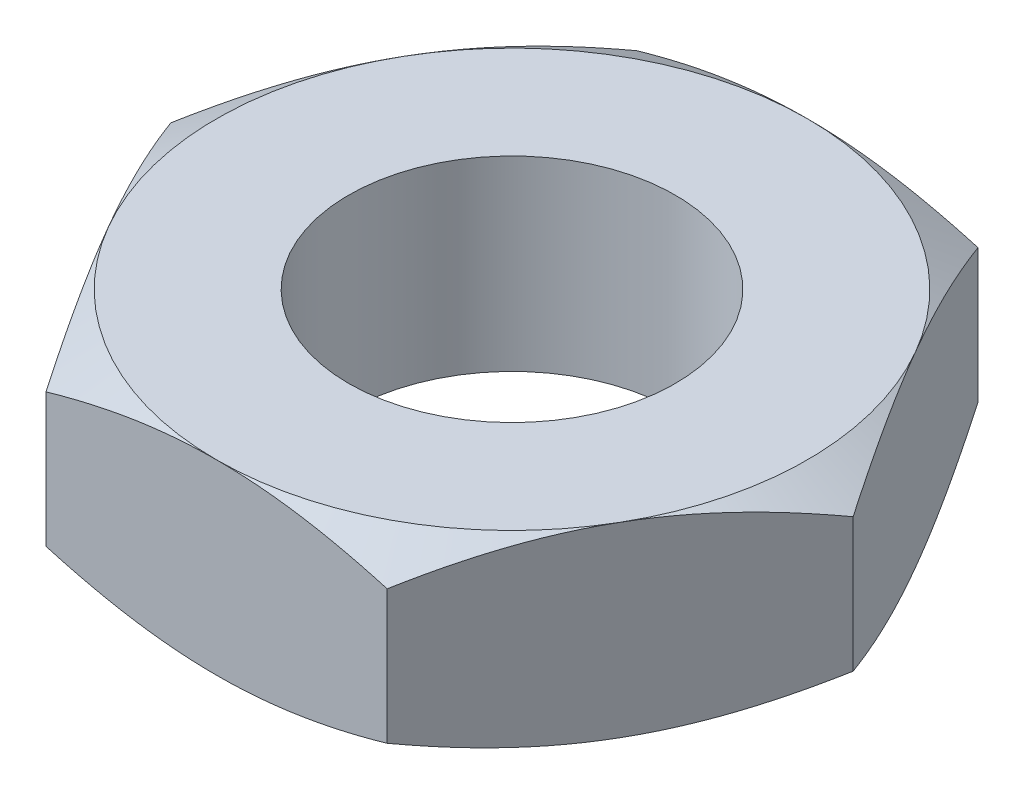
from build123d import *

# Parameters (mm, degrees)
EXTRUDE1_DEPTH         = 6
M14X1_5_TAPPED_HOLE1_D = 10.5


with BuildPart() as part:
    # Sketch1 → Extrude1 (new body)
    with BuildSketch(Plane(origin=(0, 0, 0), x_dir=(1, 0, 0), z_dir=(0, 1, 0))):
        Polygon((5.484827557, -9.5), (10.969655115, 0), (5.484827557, 9.5), (-5.484827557, 9.5), (-10.969655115, 0), (-5.484827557, -9.5), align=None)
    extrude(amount=EXTRUDE1_DEPTH)

    # Sketch2 → Cut-Revolve1 (revolve, cut)
    with BuildSketch(Plane(origin=(0, 0, 0), x_dir=(0, 0, -1), z_dir=(1, 0, 0))):
        Polygon((9.5, 6), (12.964101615, 6), (12.964101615, 4), align=None)
        Polygon((12.964101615, 0), (12.964101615, 2), (9.5, 0), align=None)
    revolve(axis=Axis((0, 0, 0), (0, 1, 0)), mode=Mode.SUBTRACT)

    # M14x1.5 Tapped Hole1 (through all)
    with Locations(Plane(origin=(0, 6, 0), x_dir=(-1, 0, 0), z_dir=(0, 1, 0))):
        with Locations((0, 0)):
            Hole(M14X1_5_TAPPED_HOLE1_D / 2)


solid = part.part
